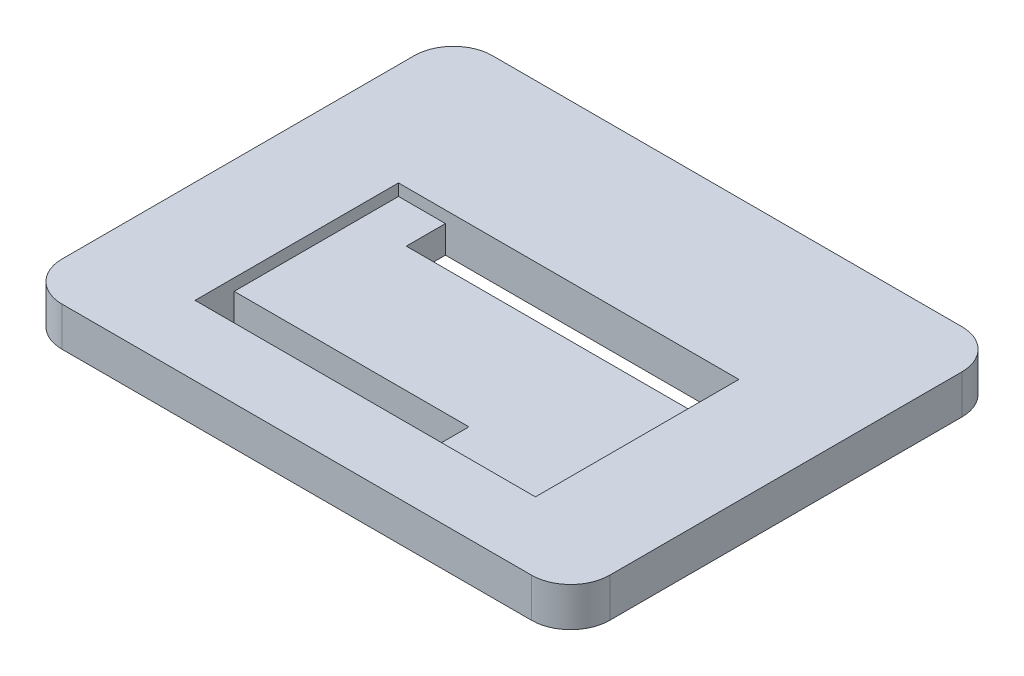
from build123d import *

# Parameters (mm, degrees)
ESQUISSE1_W             = 139.98
ESQUISSE1_H             = 110
BOSS_EXTRU_1_DEPTH      = 10
CONG_1_R                = 10
ENL_V_MAT_EXTRU_1_DEPTH = 3
ESQUISSE3_W             = 60
ESQUISSE3_H             = 10
ESQUISSE3_W_2           = 75
ENL_V_MAT_EXTRU_2_DEPTH = 17
ESQUISSE4_R             = 3.5
ENL_V_MAT_EXTRU_3_DEPTH = 6


with BuildPart() as part:
    # Esquisse1 → Boss.-Extru.1 (new body)
    with BuildSketch(Plane(origin=(0, 0, 0), x_dir=(1, 0, 0), z_dir=(0, 1, 0))):
        with Locations((-1.08631929, -18.065144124)):
            Rectangle(ESQUISSE1_W, ESQUISSE1_H)
    extrude(amount=BOSS_EXTRU_1_DEPTH)

    # Cong_1
    cong_1_edges = [part.edges().sort_by_distance(p)[0] for p in [
        (-71.07631929, 5, -36.934855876),
        (68.90368071, 5, -36.934855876),
        (68.90368071, 5, 73.065144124),
        (-71.07631929, 5, 73.065144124),
    ]]
    fillet(cong_1_edges, radius=CONG_1_R)

    # Esquisse2 → Enl_v. mat.-Extru.1 (cut)
    with BuildSketch(Plane(origin=(0, 10, 0), x_dir=(1, 0, 0), z_dir=(0, 1, 0))):
        Polygon((-44.924453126, -3.237838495), (-44.924453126, -55.237838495), (42.075546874, -55.237838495), (42.075546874, -3.237838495), (-1.08631929, -3.237838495), align=None)
    extrude(amount=-ENL_V_MAT_EXTRU_1_DEPTH, mode=Mode.SUBTRACT)

    # Esquisse3 → Enl_v. mat.-Extru.2 (cut)
    with BuildSketch(Plane(origin=(0, 7, 0), x_dir=(1, 0, 0), z_dir=(0, 1, 0))):
        with Locations((-14.924453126, -50.237838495)):
            Rectangle(ESQUISSE3_W, ESQUISSE3_H)
        with Locations((4.575546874, -8.237838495)):
            Rectangle(ESQUISSE3_W_2, ESQUISSE3_H)
    extrude(amount=-ENL_V_MAT_EXTRU_2_DEPTH, mode=Mode.SUBTRACT)

    # Esquisse4 → Enl_v. mat.-Extru.3 (cut)
    with BuildSketch(Plane.XZ):
        with Locations(Location((-64.611853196, 66.60067803, 0), (0, 0, 270))):
            Circle(ESQUISSE4_R)
        with Locations(Location((-64.611853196, -30.470389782, 0), (0, 0, 270))):
            Circle(ESQUISSE4_R)
        with Locations(Location((62.439214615, 66.60067803, 0), (0, 0, 270))):
            Circle(ESQUISSE4_R)
        with Locations(Location((62.439214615, -30.470389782, 0), (0, 0, 270))):
            Circle(ESQUISSE4_R)
    extrude(amount=-ENL_V_MAT_EXTRU_3_DEPTH, mode=Mode.SUBTRACT)


solid = part.part
